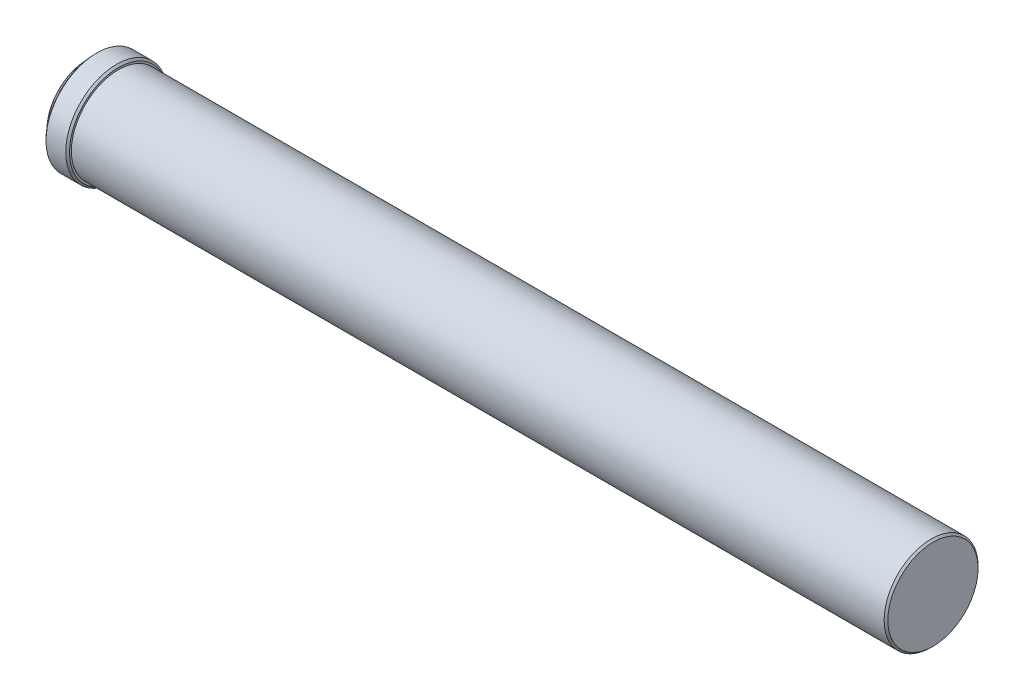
from build123d import *


with BuildPart() as part:
    # Esquisse1 → R_volution1 (revolve)
    with BuildSketch(Plane.XY, mode=Mode.PRIVATE) as r_volution1_sk:
        Polygon((0, 0), (0, 48), (-2, 50), (-867, 50), (-867, 52), (-869, 54), (-890, 54), (-892, 52), (-892, 46), (-894, 44), (-899, 44), (-900, 43), (-900, 0), align=None)
    revolve(r_volution1_sk.sketch.rotate(Axis((-900, 0, 0), (1, 0, 0)), 90), axis=Axis((-900, 0, 0), (1, 0, 0)))


solid = part.part
